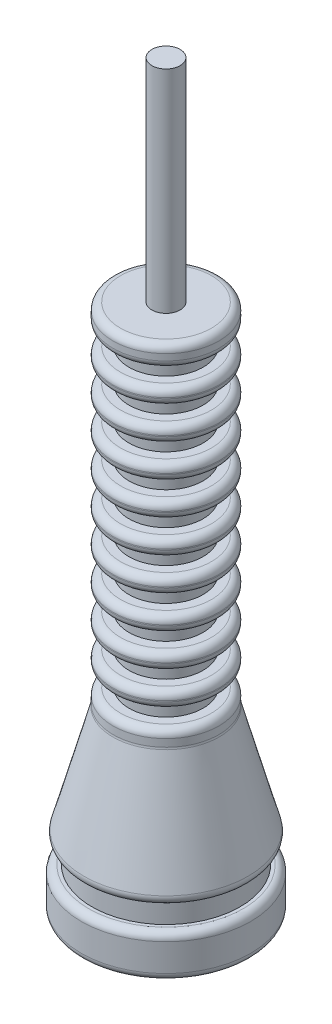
ISO-10303-21;
HEADER;
FILE_DESCRIPTION(('STEP AP214'),'2;1');
FILE_NAME('part.step','',(''),(''),'','','');
FILE_SCHEMA(('AUTOMOTIVE_DESIGN { 1 0 10303 214 1 1 1 1 }'));
ENDSEC;
DATA;
#1=APPLICATION_CONTEXT('core data for automotive mechanical design processes');
#2=APPLICATION_PROTOCOL_DEFINITION('international standard','automotive_design',2000,#1);
#3=PRODUCT_CONTEXT('',#1,'mechanical');
#4=PRODUCT('Part','Part','',(#3));
#5=PRODUCT_RELATED_PRODUCT_CATEGORY('part','',(#4));
#6=PRODUCT_DEFINITION_FORMATION('','',#4);
#7=PRODUCT_DEFINITION_CONTEXT('part definition',#1,'design');
#8=PRODUCT_DEFINITION('design','',#6,#7);
#9=PRODUCT_DEFINITION_SHAPE('','',#8);
#10=(LENGTH_UNIT() NAMED_UNIT(*) SI_UNIT(.MILLI.,.METRE.));
#11=(NAMED_UNIT(*) PLANE_ANGLE_UNIT() SI_UNIT($,.RADIAN.));
#12=(NAMED_UNIT(*) SI_UNIT($,.STERADIAN.) SOLID_ANGLE_UNIT());
#13=UNCERTAINTY_MEASURE_WITH_UNIT(LENGTH_MEASURE(1.E-05),#10,'distance_accuracy_value','');
#14=(GEOMETRIC_REPRESENTATION_CONTEXT(3) GLOBAL_UNCERTAINTY_ASSIGNED_CONTEXT((#13)) GLOBAL_UNIT_ASSIGNED_CONTEXT((#10,
#11,#12)) REPRESENTATION_CONTEXT('',''));
#15=CARTESIAN_POINT('',(0.,0.,0.));
#16=DIRECTION('',(0.,0.,1.));
#17=DIRECTION('',(1.,0.,0.));
#18=AXIS2_PLACEMENT_3D('',#15,#16,#17);
#19=CARTESIAN_POINT('',(0.,0.,0.));
#20=DIRECTION('',(0.,-1.,0.));
#21=DIRECTION('',(0.,0.,-1.));
#22=AXIS2_PLACEMENT_3D('',#19,#20,#21);
#23=PLANE('',#22);
#24=CARTESIAN_POINT('',(0.,0.,0.));
#25=DIRECTION('',(0.,-1.,0.));
#26=DIRECTION('',(0.,0.,-1.));
#27=AXIS2_PLACEMENT_3D('',#24,#25,#26);
#28=CIRCLE('',#27,7.3);
#29=CARTESIAN_POINT('',(0.,0.,-7.3));
#30=VERTEX_POINT('',#29);
#31=EDGE_CURVE('E190',#30,#30,#28,.T.);
#32=ORIENTED_EDGE('',*,*,#31,.T.);
#33=EDGE_LOOP('',(#32));
#34=FACE_BOUND('',#33,.T.);
#35=ADVANCED_FACE('F35',(#34),#23,.T.);
#36=CARTESIAN_POINT('',(0.,0.,0.));
#37=DIRECTION('',(0.,-1.,0.));
#38=DIRECTION('',(0.,0.,-1.));
#39=AXIS2_PLACEMENT_3D('',#36,#37,#38);
#40=CYLINDRICAL_SURFACE('',#39,8.);
#41=CARTESIAN_POINT('',(0.,0.7,0.));
#42=DIRECTION('',(0.,-1.,0.));
#43=DIRECTION('',(0.,0.,-1.));
#44=AXIS2_PLACEMENT_3D('',#41,#42,#43);
#45=CIRCLE('',#44,8.);
#46=CARTESIAN_POINT('',(0.,0.7,-8.));
#47=VERTEX_POINT('',#46);
#48=EDGE_CURVE('E184',#47,#47,#45,.F.);
#49=ORIENTED_EDGE('',*,*,#48,.T.);
#50=EDGE_LOOP('',(#49));
#51=FACE_BOUND('',#50,.T.);
#52=CARTESIAN_POINT('',(0.,3.3,0.));
#53=DIRECTION('',(0.,1.,0.));
#54=DIRECTION('',(0.,0.,1.));
#55=AXIS2_PLACEMENT_3D('',#52,#53,#54);
#56=CIRCLE('',#55,8.);
#57=CARTESIAN_POINT('',(0.,3.3,8.));
#58=VERTEX_POINT('',#57);
#59=EDGE_CURVE('E187',#58,#58,#56,.F.);
#60=ORIENTED_EDGE('',*,*,#59,.T.);
#61=EDGE_LOOP('',(#60));
#62=FACE_BOUND('',#61,.T.);
#63=ADVANCED_FACE('F286',(#51,#62),#40,.T.);
#64=CARTESIAN_POINT('',(8.,4.,0.));
#65=DIRECTION('',(0.,1.,0.));
#66=DIRECTION('',(0.,0.,1.));
#67=AXIS2_PLACEMENT_3D('',#64,#65,#66);
#68=PLANE('',#67);
#69=CARTESIAN_POINT('',(0.,4.,0.));
#70=DIRECTION('',(0.,1.,0.));
#71=DIRECTION('',(0.,0.,1.));
#72=AXIS2_PLACEMENT_3D('',#69,#70,#71);
#73=CIRCLE('',#72,7.3);
#74=CARTESIAN_POINT('',(0.,4.,7.3));
#75=VERTEX_POINT('',#74);
#76=EDGE_CURVE('E181',#75,#75,#73,.T.);
#77=ORIENTED_EDGE('',*,*,#76,.T.);
#78=EDGE_LOOP('',(#77));
#79=FACE_BOUND('',#78,.T.);
#80=CARTESIAN_POINT('',(0.,4.,0.));
#81=DIRECTION('',(0.,-1.,0.));
#82=DIRECTION('',(0.,0.,-1.));
#83=AXIS2_PLACEMENT_3D('',#80,#81,#82);
#84=CIRCLE('',#83,7.);
#85=CARTESIAN_POINT('',(0.,4.,-7.));
#86=VERTEX_POINT('',#85);
#87=EDGE_CURVE('E193',#86,#86,#84,.T.);
#88=ORIENTED_EDGE('',*,*,#87,.T.);
#89=EDGE_LOOP('',(#88));
#90=FACE_BOUND('',#89,.T.);
#91=ADVANCED_FACE('F292',(#79,#90),#68,.T.);
#92=CARTESIAN_POINT('',(0.,0.,0.));
#93=DIRECTION('',(0.,-1.,0.));
#94=DIRECTION('',(0.,0.,-1.));
#95=AXIS2_PLACEMENT_3D('',#92,#93,#94);
#96=CYLINDRICAL_SURFACE('',#95,7.);
#97=CARTESIAN_POINT('',(0.,6.,0.));
#98=DIRECTION('',(0.,-1.,0.));
#99=DIRECTION('',(0.,0.,-1.));
#100=AXIS2_PLACEMENT_3D('',#97,#98,#99);
#101=CIRCLE('',#100,7.);
#102=CARTESIAN_POINT('',(0.,6.,-7.));
#103=VERTEX_POINT('',#102);
#104=EDGE_CURVE('E196',#103,#103,#101,.T.);
#105=ORIENTED_EDGE('',*,*,#104,.T.);
#106=EDGE_LOOP('',(#105));
#107=FACE_BOUND('',#106,.T.);
#108=ORIENTED_EDGE('',*,*,#87,.F.);
#109=EDGE_LOOP('',(#108));
#110=FACE_BOUND('',#109,.T.);
#111=ADVANCED_FACE('F567',(#107,#110),#96,.T.);
#112=CARTESIAN_POINT('',(7.,6.,0.));
#113=DIRECTION('',(0.,-1.,0.));
#114=DIRECTION('',(0.,0.,-1.));
#115=AXIS2_PLACEMENT_3D('',#112,#113,#114);
#116=PLANE('',#115);
#117=CARTESIAN_POINT('',(0.,6.,0.));
#118=DIRECTION('',(0.,-1.,0.));
#119=DIRECTION('',(0.,0.,-1.));
#120=AXIS2_PLACEMENT_3D('',#117,#118,#119);
#121=CIRCLE('',#120,7.08352471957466);
#122=CARTESIAN_POINT('',(0.,6.,-7.08352471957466));
#123=VERTEX_POINT('',#122);
#124=EDGE_CURVE('E178',#123,#123,#121,.T.);
#125=ORIENTED_EDGE('',*,*,#124,.T.);
#126=EDGE_LOOP('',(#125));
#127=FACE_BOUND('',#126,.T.);
#128=ORIENTED_EDGE('',*,*,#104,.F.);
#129=EDGE_LOOP('',(#128));
#130=FACE_BOUND('',#129,.T.);
#131=ADVANCED_FACE('F563',(#127,#130),#116,.T.);
#132=CARTESIAN_POINT('',(0.,6.,0.));
#133=DIRECTION('',(0.,-1.,0.));
#134=DIRECTION('',(0.,0.,-1.));
#135=AXIS2_PLACEMENT_3D('',#132,#133,#134);
#136=CONICAL_SURFACE('',#135,8.,0.266252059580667);
#137=CARTESIAN_POINT('',(0.,6.88418219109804,0.));
#138=DIRECTION('',(0.,1.,0.));
#139=DIRECTION('',(0.,0.,1.));
#140=AXIS2_PLACEMENT_3D('',#137,#138,#139);
#141=CIRCLE('',#140,7.7588593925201);
#142=CARTESIAN_POINT('',(0.,6.88418219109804,7.7588593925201));
#143=VERTEX_POINT('',#142);
#144=EDGE_CURVE('E172',#143,#143,#141,.T.);
#145=ORIENTED_EDGE('',*,*,#144,.T.);
#146=EDGE_LOOP('',(#145));
#147=FACE_BOUND('',#146,.T.);
#148=CARTESIAN_POINT('',(0.,16.9095600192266,0.));
#149=DIRECTION('',(0.,-1.,0.));
#150=DIRECTION('',(0.,0.,-1.));
#151=AXIS2_PLACEMENT_3D('',#148,#149,#150);
#152=CIRCLE('',#151,5.02466532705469);
#153=CARTESIAN_POINT('',(0.,16.9095600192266,-5.02466532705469));
#154=VERTEX_POINT('',#153);
#155=EDGE_CURVE('E175',#154,#154,#152,.T.);
#156=ORIENTED_EDGE('',*,*,#155,.T.);
#157=EDGE_LOOP('',(#156));
#158=FACE_BOUND('',#157,.T.);
#159=ADVANCED_FACE('F559',(#147,#158),#136,.T.);
#160=CARTESIAN_POINT('',(0.,0.,0.));
#161=DIRECTION('',(0.,-1.,0.));
#162=DIRECTION('',(0.,0.,-1.));
#163=AXIS2_PLACEMENT_3D('',#160,#161,#162);
#164=CYLINDRICAL_SURFACE('',#163,5.00000000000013);
#165=CARTESIAN_POINT('',(0.,17.0937422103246,0.));
#166=DIRECTION('',(0.,-1.,0.));
#167=DIRECTION('',(0.,0.,-1.));
#168=AXIS2_PLACEMENT_3D('',#165,#166,#167);
#169=CIRCLE('',#168,5.00000000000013);
#170=CARTESIAN_POINT('',(0.,17.0937422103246,-5.00000000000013));
#171=VERTEX_POINT('',#170);
#172=EDGE_CURVE('E166',#171,#171,#169,.F.);
#173=ORIENTED_EDGE('',*,*,#172,.T.);
#174=EDGE_LOOP('',(#173));
#175=FACE_BOUND('',#174,.T.);
#176=CARTESIAN_POINT('',(0.,17.7999995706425,0.));
#177=DIRECTION('',(0.,1.,0.));
#178=DIRECTION('',(0.,0.,1.));
#179=AXIS2_PLACEMENT_3D('',#176,#177,#178);
#180=CIRCLE('',#179,5.00000000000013);
#181=CARTESIAN_POINT('',(0.,17.7999995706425,5.00000000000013));
#182=VERTEX_POINT('',#181);
#183=EDGE_CURVE('E169',#182,#182,#180,.F.);
#184=ORIENTED_EDGE('',*,*,#183,.T.);
#185=EDGE_LOOP('',(#184));
#186=FACE_BOUND('',#185,.T.);
#187=ADVANCED_FACE('F555',(#175,#186),#164,.T.);
#188=CARTESIAN_POINT('',(3.50000000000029,18.4999995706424,0.));
#189=DIRECTION('',(0.,1.,0.));
#190=DIRECTION('',(0.,0.,1.));
#191=AXIS2_PLACEMENT_3D('',#188,#189,#190);
#192=PLANE('',#191);
#193=CARTESIAN_POINT('',(0.,18.4999995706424,0.));
#194=DIRECTION('',(0.,1.,0.));
#195=DIRECTION('',(0.,0.,1.));
#196=AXIS2_PLACEMENT_3D('',#193,#194,#195);
#197=CIRCLE('',#196,4.30000000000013);
#198=CARTESIAN_POINT('',(0.,18.4999995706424,4.30000000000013));
#199=VERTEX_POINT('',#198);
#200=EDGE_CURVE('E163',#199,#199,#197,.T.);
#201=ORIENTED_EDGE('',*,*,#200,.T.);
#202=EDGE_LOOP('',(#201));
#203=FACE_BOUND('',#202,.T.);
#204=CARTESIAN_POINT('',(0.,18.4999995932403,0.));
#205=DIRECTION('',(0.,-1.,0.));
#206=DIRECTION('',(0.,0.,-1.));
#207=AXIS2_PLACEMENT_3D('',#204,#205,#206);
#208=CIRCLE('',#207,3.50000000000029);
#209=CARTESIAN_POINT('',(0.,18.4999995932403,-3.50000000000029));
#210=VERTEX_POINT('',#209);
#211=EDGE_CURVE('E199',#210,#210,#208,.T.);
#212=ORIENTED_EDGE('',*,*,#211,.T.);
#213=EDGE_LOOP('',(#212));
#214=FACE_BOUND('',#213,.T.);
#215=ADVANCED_FACE('F551',(#203,#214),#192,.T.);
#216=CARTESIAN_POINT('',(0.,0.,0.));
#217=DIRECTION('',(0.,-1.,0.));
#218=DIRECTION('',(0.,0.,-1.));
#219=AXIS2_PLACEMENT_3D('',#216,#217,#218);
#220=CYLINDRICAL_SURFACE('',#219,3.50000000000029);
#221=CARTESIAN_POINT('',(0.,20.0999995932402,0.));
#222=DIRECTION('',(0.,-1.,0.));
#223=DIRECTION('',(0.,0.,-1.));
#224=AXIS2_PLACEMENT_3D('',#221,#222,#223);
#225=CIRCLE('',#224,3.50000000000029);
#226=CARTESIAN_POINT('',(0.,20.0999995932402,-3.50000000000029));
#227=VERTEX_POINT('',#226);
#228=EDGE_CURVE('E202',#227,#227,#225,.T.);
#229=ORIENTED_EDGE('',*,*,#228,.T.);
#230=EDGE_LOOP('',(#229));
#231=FACE_BOUND('',#230,.T.);
#232=ORIENTED_EDGE('',*,*,#211,.F.);
#233=EDGE_LOOP('',(#232));
#234=FACE_BOUND('',#233,.T.);
#235=ADVANCED_FACE('F547',(#231,#234),#220,.T.);
#236=CARTESIAN_POINT('',(5.00000000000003,20.0999995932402,0.));
#237=DIRECTION('',(0.,-1.,0.));
#238=DIRECTION('',(0.,0.,-1.));
#239=AXIS2_PLACEMENT_3D('',#236,#237,#238);
#240=PLANE('',#239);
#241=CARTESIAN_POINT('',(0.,20.0999995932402,0.));
#242=DIRECTION('',(0.,-1.,0.));
#243=DIRECTION('',(0.,0.,-1.));
#244=AXIS2_PLACEMENT_3D('',#241,#242,#243);
#245=CIRCLE('',#244,4.30000000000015);
#246=CARTESIAN_POINT('',(0.,20.0999995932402,-4.30000000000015));
#247=VERTEX_POINT('',#246);
#248=EDGE_CURVE('E160',#247,#247,#245,.T.);
#249=ORIENTED_EDGE('',*,*,#248,.T.);
#250=EDGE_LOOP('',(#249));
#251=FACE_BOUND('',#250,.T.);
#252=ORIENTED_EDGE('',*,*,#228,.F.);
#253=EDGE_LOOP('',(#252));
#254=FACE_BOUND('',#253,.T.);
#255=ADVANCED_FACE('F543',(#251,#254),#240,.T.);
#256=CARTESIAN_POINT('',(0.,0.,0.));
#257=DIRECTION('',(0.,-1.,0.));
#258=DIRECTION('',(0.,0.,-1.));
#259=AXIS2_PLACEMENT_3D('',#256,#257,#258);
#260=CYLINDRICAL_SURFACE('',#259,5.00000000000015);
#261=CARTESIAN_POINT('',(0.,20.7999995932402,0.));
#262=DIRECTION('',(0.,-1.,0.));
#263=DIRECTION('',(0.,0.,-1.));
#264=AXIS2_PLACEMENT_3D('',#261,#262,#263);
#265=CIRCLE('',#264,5.00000000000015);
#266=CARTESIAN_POINT('',(0.,20.7999995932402,-5.00000000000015));
#267=VERTEX_POINT('',#266);
#268=EDGE_CURVE('E154',#267,#267,#265,.F.);
#269=ORIENTED_EDGE('',*,*,#268,.T.);
#270=EDGE_LOOP('',(#269));
#271=FACE_BOUND('',#270,.T.);
#272=CARTESIAN_POINT('',(0.,20.899999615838,0.));
#273=DIRECTION('',(0.,1.,0.));
#274=DIRECTION('',(0.,0.,1.));
#275=AXIS2_PLACEMENT_3D('',#272,#273,#274);
#276=CIRCLE('',#275,5.00000000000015);
#277=CARTESIAN_POINT('',(0.,20.899999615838,5.00000000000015));
#278=VERTEX_POINT('',#277);
#279=EDGE_CURVE('E157',#278,#278,#276,.F.);
#280=ORIENTED_EDGE('',*,*,#279,.T.);
#281=EDGE_LOOP('',(#280));
#282=FACE_BOUND('',#281,.T.);
#283=ADVANCED_FACE('F539',(#271,#282),#260,.T.);
#284=CARTESIAN_POINT('',(3.50000000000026,21.599999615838,0.));
#285=DIRECTION('',(0.,1.,0.));
#286=DIRECTION('',(0.,0.,1.));
#287=AXIS2_PLACEMENT_3D('',#284,#285,#286);
#288=PLANE('',#287);
#289=CARTESIAN_POINT('',(0.,21.599999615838,0.));
#290=DIRECTION('',(0.,1.,0.));
#291=DIRECTION('',(0.,0.,1.));
#292=AXIS2_PLACEMENT_3D('',#289,#290,#291);
#293=CIRCLE('',#292,4.30000000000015);
#294=CARTESIAN_POINT('',(0.,21.599999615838,4.30000000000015));
#295=VERTEX_POINT('',#294);
#296=EDGE_CURVE('E151',#295,#295,#293,.T.);
#297=ORIENTED_EDGE('',*,*,#296,.T.);
#298=EDGE_LOOP('',(#297));
#299=FACE_BOUND('',#298,.T.);
#300=CARTESIAN_POINT('',(0.,21.5999996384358,0.));
#301=DIRECTION('',(0.,-1.,0.));
#302=DIRECTION('',(0.,0.,-1.));
#303=AXIS2_PLACEMENT_3D('',#300,#301,#302);
#304=CIRCLE('',#303,3.50000000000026);
#305=CARTESIAN_POINT('',(0.,21.5999996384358,-3.50000000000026));
#306=VERTEX_POINT('',#305);
#307=EDGE_CURVE('E205',#306,#306,#304,.T.);
#308=ORIENTED_EDGE('',*,*,#307,.T.);
#309=EDGE_LOOP('',(#308));
#310=FACE_BOUND('',#309,.T.);
#311=ADVANCED_FACE('F535',(#299,#310),#288,.T.);
#312=CARTESIAN_POINT('',(0.,0.,0.));
#313=DIRECTION('',(0.,-1.,0.));
#314=DIRECTION('',(0.,0.,-1.));
#315=AXIS2_PLACEMENT_3D('',#312,#313,#314);
#316=CYLINDRICAL_SURFACE('',#315,3.50000000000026);
#317=CARTESIAN_POINT('',(0.,23.1999996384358,0.));
#318=DIRECTION('',(0.,-1.,0.));
#319=DIRECTION('',(0.,0.,-1.));
#320=AXIS2_PLACEMENT_3D('',#317,#318,#319);
#321=CIRCLE('',#320,3.50000000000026);
#322=CARTESIAN_POINT('',(0.,23.1999996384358,-3.50000000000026));
#323=VERTEX_POINT('',#322);
#324=EDGE_CURVE('E208',#323,#323,#321,.T.);
#325=ORIENTED_EDGE('',*,*,#324,.T.);
#326=EDGE_LOOP('',(#325));
#327=FACE_BOUND('',#326,.T.);
#328=ORIENTED_EDGE('',*,*,#307,.F.);
#329=EDGE_LOOP('',(#328));
#330=FACE_BOUND('',#329,.T.);
#331=ADVANCED_FACE('F531',(#327,#330),#316,.T.);
#332=CARTESIAN_POINT('',(5.00000000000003,23.1999996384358,0.));
#333=DIRECTION('',(0.,-1.,0.));
#334=DIRECTION('',(0.,0.,-1.));
#335=AXIS2_PLACEMENT_3D('',#332,#333,#334);
#336=PLANE('',#335);
#337=CARTESIAN_POINT('',(0.,23.1999996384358,0.));
#338=DIRECTION('',(0.,-1.,0.));
#339=DIRECTION('',(0.,0.,-1.));
#340=AXIS2_PLACEMENT_3D('',#337,#338,#339);
#341=CIRCLE('',#340,4.30000000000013);
#342=CARTESIAN_POINT('',(0.,23.1999996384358,-4.30000000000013));
#343=VERTEX_POINT('',#342);
#344=EDGE_CURVE('E148',#343,#343,#341,.T.);
#345=ORIENTED_EDGE('',*,*,#344,.T.);
#346=EDGE_LOOP('',(#345));
#347=FACE_BOUND('',#346,.T.);
#348=ORIENTED_EDGE('',*,*,#324,.F.);
#349=EDGE_LOOP('',(#348));
#350=FACE_BOUND('',#349,.T.);
#351=ADVANCED_FACE('F527',(#347,#350),#336,.T.);
#352=CARTESIAN_POINT('',(0.,0.,0.));
#353=DIRECTION('',(0.,-1.,0.));
#354=DIRECTION('',(0.,0.,-1.));
#355=AXIS2_PLACEMENT_3D('',#352,#353,#354);
#356=CYLINDRICAL_SURFACE('',#355,5.00000000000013);
#357=CARTESIAN_POINT('',(0.,23.8999996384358,0.));
#358=DIRECTION('',(0.,-1.,0.));
#359=DIRECTION('',(0.,0.,-1.));
#360=AXIS2_PLACEMENT_3D('',#357,#358,#359);
#361=CIRCLE('',#360,5.00000000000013);
#362=CARTESIAN_POINT('',(0.,23.8999996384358,-5.00000000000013));
#363=VERTEX_POINT('',#362);
#364=EDGE_CURVE('E142',#363,#363,#361,.F.);
#365=ORIENTED_EDGE('',*,*,#364,.T.);
#366=EDGE_LOOP('',(#365));
#367=FACE_BOUND('',#366,.T.);
#368=CARTESIAN_POINT('',(0.,23.9999996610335,0.));
#369=DIRECTION('',(0.,1.,0.));
#370=DIRECTION('',(0.,0.,1.));
#371=AXIS2_PLACEMENT_3D('',#368,#369,#370);
#372=CIRCLE('',#371,5.00000000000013);
#373=CARTESIAN_POINT('',(0.,23.9999996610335,5.00000000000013));
#374=VERTEX_POINT('',#373);
#375=EDGE_CURVE('E145',#374,#374,#372,.F.);
#376=ORIENTED_EDGE('',*,*,#375,.T.);
#377=EDGE_LOOP('',(#376));
#378=FACE_BOUND('',#377,.T.);
#379=ADVANCED_FACE('F523',(#367,#378),#356,.T.);
#380=CARTESIAN_POINT('',(3.50000000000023,24.6999996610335,0.));
#381=DIRECTION('',(0.,1.,0.));
#382=DIRECTION('',(0.,0.,1.));
#383=AXIS2_PLACEMENT_3D('',#380,#381,#382);
#384=PLANE('',#383);
#385=CARTESIAN_POINT('',(0.,24.6999996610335,0.));
#386=DIRECTION('',(0.,1.,0.));
#387=DIRECTION('',(0.,0.,1.));
#388=AXIS2_PLACEMENT_3D('',#385,#386,#387);
#389=CIRCLE('',#388,4.30000000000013);
#390=CARTESIAN_POINT('',(0.,24.6999996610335,4.30000000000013));
#391=VERTEX_POINT('',#390);
#392=EDGE_CURVE('E139',#391,#391,#389,.T.);
#393=ORIENTED_EDGE('',*,*,#392,.T.);
#394=EDGE_LOOP('',(#393));
#395=FACE_BOUND('',#394,.T.);
#396=CARTESIAN_POINT('',(0.,24.6999996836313,0.));
#397=DIRECTION('',(0.,-1.,0.));
#398=DIRECTION('',(0.,0.,-1.));
#399=AXIS2_PLACEMENT_3D('',#396,#397,#398);
#400=CIRCLE('',#399,3.50000000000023);
#401=CARTESIAN_POINT('',(0.,24.6999996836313,-3.50000000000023));
#402=VERTEX_POINT('',#401);
#403=EDGE_CURVE('E211',#402,#402,#400,.T.);
#404=ORIENTED_EDGE('',*,*,#403,.T.);
#405=EDGE_LOOP('',(#404));
#406=FACE_BOUND('',#405,.T.);
#407=ADVANCED_FACE('F519',(#395,#406),#384,.T.);
#408=CARTESIAN_POINT('',(0.,0.,0.));
#409=DIRECTION('',(0.,-1.,0.));
#410=DIRECTION('',(0.,0.,-1.));
#411=AXIS2_PLACEMENT_3D('',#408,#409,#410);
#412=CYLINDRICAL_SURFACE('',#411,3.50000000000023);
#413=CARTESIAN_POINT('',(0.,26.2999996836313,0.));
#414=DIRECTION('',(0.,-1.,0.));
#415=DIRECTION('',(0.,0.,-1.));
#416=AXIS2_PLACEMENT_3D('',#413,#414,#415);
#417=CIRCLE('',#416,3.50000000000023);
#418=CARTESIAN_POINT('',(0.,26.2999996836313,-3.50000000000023));
#419=VERTEX_POINT('',#418);
#420=EDGE_CURVE('E214',#419,#419,#417,.T.);
#421=ORIENTED_EDGE('',*,*,#420,.T.);
#422=EDGE_LOOP('',(#421));
#423=FACE_BOUND('',#422,.T.);
#424=ORIENTED_EDGE('',*,*,#403,.F.);
#425=EDGE_LOOP('',(#424));
#426=FACE_BOUND('',#425,.T.);
#427=ADVANCED_FACE('F515',(#423,#426),#412,.T.);
#428=CARTESIAN_POINT('',(5.00000000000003,26.2999996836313,0.));
#429=DIRECTION('',(0.,-1.,0.));
#430=DIRECTION('',(0.,0.,-1.));
#431=AXIS2_PLACEMENT_3D('',#428,#429,#430);
#432=PLANE('',#431);
#433=CARTESIAN_POINT('',(0.,26.2999996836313,0.));
#434=DIRECTION('',(0.,-1.,0.));
#435=DIRECTION('',(0.,0.,-1.));
#436=AXIS2_PLACEMENT_3D('',#433,#434,#435);
#437=CIRCLE('',#436,4.30000000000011);
#438=CARTESIAN_POINT('',(0.,26.2999996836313,-4.30000000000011));
#439=VERTEX_POINT('',#438);
#440=EDGE_CURVE('E136',#439,#439,#437,.T.);
#441=ORIENTED_EDGE('',*,*,#440,.T.);
#442=EDGE_LOOP('',(#441));
#443=FACE_BOUND('',#442,.T.);
#444=ORIENTED_EDGE('',*,*,#420,.F.);
#445=EDGE_LOOP('',(#444));
#446=FACE_BOUND('',#445,.T.);
#447=ADVANCED_FACE('F511',(#443,#446),#432,.T.);
#448=CARTESIAN_POINT('',(0.,0.,0.));
#449=DIRECTION('',(0.,-1.,0.));
#450=DIRECTION('',(0.,0.,-1.));
#451=AXIS2_PLACEMENT_3D('',#448,#449,#450);
#452=CYLINDRICAL_SURFACE('',#451,5.00000000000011);
#453=CARTESIAN_POINT('',(0.,26.9999996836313,0.));
#454=DIRECTION('',(0.,-1.,0.));
#455=DIRECTION('',(0.,0.,-1.));
#456=AXIS2_PLACEMENT_3D('',#453,#454,#455);
#457=CIRCLE('',#456,5.00000000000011);
#458=CARTESIAN_POINT('',(0.,26.9999996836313,-5.00000000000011));
#459=VERTEX_POINT('',#458);
#460=EDGE_CURVE('E130',#459,#459,#457,.F.);
#461=ORIENTED_EDGE('',*,*,#460,.T.);
#462=EDGE_LOOP('',(#461));
#463=FACE_BOUND('',#462,.T.);
#464=CARTESIAN_POINT('',(0.,27.0999997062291,0.));
#465=DIRECTION('',(0.,1.,0.));
#466=DIRECTION('',(0.,0.,1.));
#467=AXIS2_PLACEMENT_3D('',#464,#465,#466);
#468=CIRCLE('',#467,5.00000000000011);
#469=CARTESIAN_POINT('',(0.,27.0999997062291,5.00000000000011));
#470=VERTEX_POINT('',#469);
#471=EDGE_CURVE('E133',#470,#470,#468,.F.);
#472=ORIENTED_EDGE('',*,*,#471,.T.);
#473=EDGE_LOOP('',(#472));
#474=FACE_BOUND('',#473,.T.);
#475=ADVANCED_FACE('F507',(#463,#474),#452,.T.);
#476=CARTESIAN_POINT('',(3.50000000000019,27.7999997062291,0.));
#477=DIRECTION('',(0.,1.,0.));
#478=DIRECTION('',(0.,0.,1.));
#479=AXIS2_PLACEMENT_3D('',#476,#477,#478);
#480=PLANE('',#479);
#481=CARTESIAN_POINT('',(0.,27.7999997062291,0.));
#482=DIRECTION('',(0.,1.,0.));
#483=DIRECTION('',(0.,0.,1.));
#484=AXIS2_PLACEMENT_3D('',#481,#482,#483);
#485=CIRCLE('',#484,4.30000000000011);
#486=CARTESIAN_POINT('',(0.,27.7999997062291,4.30000000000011));
#487=VERTEX_POINT('',#486);
#488=EDGE_CURVE('E127',#487,#487,#485,.T.);
#489=ORIENTED_EDGE('',*,*,#488,.T.);
#490=EDGE_LOOP('',(#489));
#491=FACE_BOUND('',#490,.T.);
#492=CARTESIAN_POINT('',(0.,27.7999997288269,0.));
#493=DIRECTION('',(0.,-1.,0.));
#494=DIRECTION('',(0.,0.,-1.));
#495=AXIS2_PLACEMENT_3D('',#492,#493,#494);
#496=CIRCLE('',#495,3.50000000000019);
#497=CARTESIAN_POINT('',(0.,27.7999997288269,-3.50000000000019));
#498=VERTEX_POINT('',#497);
#499=EDGE_CURVE('E217',#498,#498,#496,.T.);
#500=ORIENTED_EDGE('',*,*,#499,.T.);
#501=EDGE_LOOP('',(#500));
#502=FACE_BOUND('',#501,.T.);
#503=ADVANCED_FACE('F503',(#491,#502),#480,.T.);
#504=CARTESIAN_POINT('',(0.,0.,0.));
#505=DIRECTION('',(0.,-1.,0.));
#506=DIRECTION('',(0.,0.,-1.));
#507=AXIS2_PLACEMENT_3D('',#504,#505,#506);
#508=CYLINDRICAL_SURFACE('',#507,3.50000000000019);
#509=CARTESIAN_POINT('',(0.,29.3999997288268,0.));
#510=DIRECTION('',(0.,-1.,0.));
#511=DIRECTION('',(0.,0.,-1.));
#512=AXIS2_PLACEMENT_3D('',#509,#510,#511);
#513=CIRCLE('',#512,3.50000000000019);
#514=CARTESIAN_POINT('',(0.,29.3999997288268,-3.50000000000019));
#515=VERTEX_POINT('',#514);
#516=EDGE_CURVE('E220',#515,#515,#513,.T.);
#517=ORIENTED_EDGE('',*,*,#516,.T.);
#518=EDGE_LOOP('',(#517));
#519=FACE_BOUND('',#518,.T.);
#520=ORIENTED_EDGE('',*,*,#499,.F.);
#521=EDGE_LOOP('',(#520));
#522=FACE_BOUND('',#521,.T.);
#523=ADVANCED_FACE('F499',(#519,#522),#508,.T.);
#524=CARTESIAN_POINT('',(5.00000000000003,29.3999997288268,0.));
#525=DIRECTION('',(0.,-1.,0.));
#526=DIRECTION('',(0.,0.,-1.));
#527=AXIS2_PLACEMENT_3D('',#524,#525,#526);
#528=PLANE('',#527);
#529=CARTESIAN_POINT('',(0.,29.3999997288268,0.));
#530=DIRECTION('',(0.,-1.,0.));
#531=DIRECTION('',(0.,0.,-1.));
#532=AXIS2_PLACEMENT_3D('',#529,#530,#531);
#533=CIRCLE('',#532,4.3000000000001);
#534=CARTESIAN_POINT('',(0.,29.3999997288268,-4.3000000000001));
#535=VERTEX_POINT('',#534);
#536=EDGE_CURVE('E124',#535,#535,#533,.T.);
#537=ORIENTED_EDGE('',*,*,#536,.T.);
#538=EDGE_LOOP('',(#537));
#539=FACE_BOUND('',#538,.T.);
#540=ORIENTED_EDGE('',*,*,#516,.F.);
#541=EDGE_LOOP('',(#540));
#542=FACE_BOUND('',#541,.T.);
#543=ADVANCED_FACE('F495',(#539,#542),#528,.T.);
#544=CARTESIAN_POINT('',(0.,0.,0.));
#545=DIRECTION('',(0.,-1.,0.));
#546=DIRECTION('',(0.,0.,-1.));
#547=AXIS2_PLACEMENT_3D('',#544,#545,#546);
#548=CYLINDRICAL_SURFACE('',#547,5.0000000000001);
#549=CARTESIAN_POINT('',(0.,30.0999997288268,0.));
#550=DIRECTION('',(0.,-1.,0.));
#551=DIRECTION('',(0.,0.,-1.));
#552=AXIS2_PLACEMENT_3D('',#549,#550,#551);
#553=CIRCLE('',#552,5.0000000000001);
#554=CARTESIAN_POINT('',(0.,30.0999997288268,-5.0000000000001));
#555=VERTEX_POINT('',#554);
#556=EDGE_CURVE('E118',#555,#555,#553,.F.);
#557=ORIENTED_EDGE('',*,*,#556,.T.);
#558=EDGE_LOOP('',(#557));
#559=FACE_BOUND('',#558,.T.);
#560=CARTESIAN_POINT('',(0.,30.1999997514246,0.));
#561=DIRECTION('',(0.,1.,0.));
#562=DIRECTION('',(0.,0.,1.));
#563=AXIS2_PLACEMENT_3D('',#560,#561,#562);
#564=CIRCLE('',#563,5.0000000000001);
#565=CARTESIAN_POINT('',(0.,30.1999997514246,5.0000000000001));
#566=VERTEX_POINT('',#565);
#567=EDGE_CURVE('E121',#566,#566,#564,.F.);
#568=ORIENTED_EDGE('',*,*,#567,.T.);
#569=EDGE_LOOP('',(#568));
#570=FACE_BOUND('',#569,.T.);
#571=ADVANCED_FACE('F491',(#559,#570),#548,.T.);
#572=CARTESIAN_POINT('',(3.50000000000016,30.8999997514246,0.));
#573=DIRECTION('',(0.,1.,0.));
#574=DIRECTION('',(0.,0.,1.));
#575=AXIS2_PLACEMENT_3D('',#572,#573,#574);
#576=PLANE('',#575);
#577=CARTESIAN_POINT('',(0.,30.8999997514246,0.));
#578=DIRECTION('',(0.,1.,0.));
#579=DIRECTION('',(0.,0.,1.));
#580=AXIS2_PLACEMENT_3D('',#577,#578,#579);
#581=CIRCLE('',#580,4.3000000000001);
#582=CARTESIAN_POINT('',(0.,30.8999997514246,4.3000000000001));
#583=VERTEX_POINT('',#582);
#584=EDGE_CURVE('E115',#583,#583,#581,.T.);
#585=ORIENTED_EDGE('',*,*,#584,.T.);
#586=EDGE_LOOP('',(#585));
#587=FACE_BOUND('',#586,.T.);
#588=CARTESIAN_POINT('',(0.,30.8999997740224,0.));
#589=DIRECTION('',(0.,-1.,0.));
#590=DIRECTION('',(0.,0.,-1.));
#591=AXIS2_PLACEMENT_3D('',#588,#589,#590);
#592=CIRCLE('',#591,3.50000000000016);
#593=CARTESIAN_POINT('',(0.,30.8999997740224,-3.50000000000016));
#594=VERTEX_POINT('',#593);
#595=EDGE_CURVE('E223',#594,#594,#592,.T.);
#596=ORIENTED_EDGE('',*,*,#595,.T.);
#597=EDGE_LOOP('',(#596));
#598=FACE_BOUND('',#597,.T.);
#599=ADVANCED_FACE('F487',(#587,#598),#576,.T.);
#600=CARTESIAN_POINT('',(0.,0.,0.));
#601=DIRECTION('',(0.,-1.,0.));
#602=DIRECTION('',(0.,0.,-1.));
#603=AXIS2_PLACEMENT_3D('',#600,#601,#602);
#604=CYLINDRICAL_SURFACE('',#603,3.50000000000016);
#605=CARTESIAN_POINT('',(0.,32.4999997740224,0.));
#606=DIRECTION('',(0.,-1.,0.));
#607=DIRECTION('',(0.,0.,-1.));
#608=AXIS2_PLACEMENT_3D('',#605,#606,#607);
#609=CIRCLE('',#608,3.50000000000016);
#610=CARTESIAN_POINT('',(0.,32.4999997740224,-3.50000000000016));
#611=VERTEX_POINT('',#610);
#612=EDGE_CURVE('E226',#611,#611,#609,.T.);
#613=ORIENTED_EDGE('',*,*,#612,.T.);
#614=EDGE_LOOP('',(#613));
#615=FACE_BOUND('',#614,.T.);
#616=ORIENTED_EDGE('',*,*,#595,.F.);
#617=EDGE_LOOP('',(#616));
#618=FACE_BOUND('',#617,.T.);
#619=ADVANCED_FACE('F483',(#615,#618),#604,.T.);
#620=CARTESIAN_POINT('',(5.00000000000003,32.4999997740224,0.));
#621=DIRECTION('',(0.,-1.,0.));
#622=DIRECTION('',(0.,0.,-1.));
#623=AXIS2_PLACEMENT_3D('',#620,#621,#622);
#624=PLANE('',#623);
#625=CARTESIAN_POINT('',(0.,32.4999997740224,0.));
#626=DIRECTION('',(0.,-1.,0.));
#627=DIRECTION('',(0.,0.,-1.));
#628=AXIS2_PLACEMENT_3D('',#625,#626,#627);
#629=CIRCLE('',#628,4.30000000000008);
#630=CARTESIAN_POINT('',(0.,32.4999997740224,-4.30000000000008));
#631=VERTEX_POINT('',#630);
#632=EDGE_CURVE('E112',#631,#631,#629,.T.);
#633=ORIENTED_EDGE('',*,*,#632,.T.);
#634=EDGE_LOOP('',(#633));
#635=FACE_BOUND('',#634,.T.);
#636=ORIENTED_EDGE('',*,*,#612,.F.);
#637=EDGE_LOOP('',(#636));
#638=FACE_BOUND('',#637,.T.);
#639=ADVANCED_FACE('F479',(#635,#638),#624,.T.);
#640=CARTESIAN_POINT('',(0.,0.,0.));
#641=DIRECTION('',(0.,-1.,0.));
#642=DIRECTION('',(0.,0.,-1.));
#643=AXIS2_PLACEMENT_3D('',#640,#641,#642);
#644=CYLINDRICAL_SURFACE('',#643,5.00000000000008);
#645=CARTESIAN_POINT('',(0.,33.1999997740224,0.));
#646=DIRECTION('',(0.,-1.,0.));
#647=DIRECTION('',(0.,0.,-1.));
#648=AXIS2_PLACEMENT_3D('',#645,#646,#647);
#649=CIRCLE('',#648,5.00000000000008);
#650=CARTESIAN_POINT('',(0.,33.1999997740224,-5.00000000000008));
#651=VERTEX_POINT('',#650);
#652=EDGE_CURVE('E106',#651,#651,#649,.F.);
#653=ORIENTED_EDGE('',*,*,#652,.T.);
#654=EDGE_LOOP('',(#653));
#655=FACE_BOUND('',#654,.T.);
#656=CARTESIAN_POINT('',(0.,33.2999997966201,0.));
#657=DIRECTION('',(0.,1.,0.));
#658=DIRECTION('',(0.,0.,1.));
#659=AXIS2_PLACEMENT_3D('',#656,#657,#658);
#660=CIRCLE('',#659,5.00000000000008);
#661=CARTESIAN_POINT('',(0.,33.2999997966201,5.00000000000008));
#662=VERTEX_POINT('',#661);
#663=EDGE_CURVE('E109',#662,#662,#660,.F.);
#664=ORIENTED_EDGE('',*,*,#663,.T.);
#665=EDGE_LOOP('',(#664));
#666=FACE_BOUND('',#665,.T.);
#667=ADVANCED_FACE('F475',(#655,#666),#644,.T.);
#668=CARTESIAN_POINT('',(3.50000000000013,33.9999997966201,0.));
#669=DIRECTION('',(0.,1.,0.));
#670=DIRECTION('',(0.,0.,1.));
#671=AXIS2_PLACEMENT_3D('',#668,#669,#670);
#672=PLANE('',#671);
#673=CARTESIAN_POINT('',(0.,33.9999997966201,0.));
#674=DIRECTION('',(0.,1.,0.));
#675=DIRECTION('',(0.,0.,1.));
#676=AXIS2_PLACEMENT_3D('',#673,#674,#675);
#677=CIRCLE('',#676,4.30000000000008);
#678=CARTESIAN_POINT('',(0.,33.9999997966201,4.30000000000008));
#679=VERTEX_POINT('',#678);
#680=EDGE_CURVE('E103',#679,#679,#677,.T.);
#681=ORIENTED_EDGE('',*,*,#680,.T.);
#682=EDGE_LOOP('',(#681));
#683=FACE_BOUND('',#682,.T.);
#684=CARTESIAN_POINT('',(0.,33.9999998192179,0.));
#685=DIRECTION('',(0.,-1.,0.));
#686=DIRECTION('',(0.,0.,-1.));
#687=AXIS2_PLACEMENT_3D('',#684,#685,#686);
#688=CIRCLE('',#687,3.50000000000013);
#689=CARTESIAN_POINT('',(0.,33.9999998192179,-3.50000000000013));
#690=VERTEX_POINT('',#689);
#691=EDGE_CURVE('E229',#690,#690,#688,.T.);
#692=ORIENTED_EDGE('',*,*,#691,.T.);
#693=EDGE_LOOP('',(#692));
#694=FACE_BOUND('',#693,.T.);
#695=ADVANCED_FACE('F471',(#683,#694),#672,.T.);
#696=CARTESIAN_POINT('',(0.,0.,0.));
#697=DIRECTION('',(0.,-1.,0.));
#698=DIRECTION('',(0.,0.,-1.));
#699=AXIS2_PLACEMENT_3D('',#696,#697,#698);
#700=CYLINDRICAL_SURFACE('',#699,3.50000000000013);
#701=CARTESIAN_POINT('',(0.,35.5999998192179,0.));
#702=DIRECTION('',(0.,-1.,0.));
#703=DIRECTION('',(0.,0.,-1.));
#704=AXIS2_PLACEMENT_3D('',#701,#702,#703);
#705=CIRCLE('',#704,3.50000000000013);
#706=CARTESIAN_POINT('',(0.,35.5999998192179,-3.50000000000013));
#707=VERTEX_POINT('',#706);
#708=EDGE_CURVE('E232',#707,#707,#705,.T.);
#709=ORIENTED_EDGE('',*,*,#708,.T.);
#710=EDGE_LOOP('',(#709));
#711=FACE_BOUND('',#710,.T.);
#712=ORIENTED_EDGE('',*,*,#691,.F.);
#713=EDGE_LOOP('',(#712));
#714=FACE_BOUND('',#713,.T.);
#715=ADVANCED_FACE('F467',(#711,#714),#700,.T.);
#716=CARTESIAN_POINT('',(5.00000000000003,35.5999998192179,0.));
#717=DIRECTION('',(0.,-1.,0.));
#718=DIRECTION('',(0.,0.,-1.));
#719=AXIS2_PLACEMENT_3D('',#716,#717,#718);
#720=PLANE('',#719);
#721=CARTESIAN_POINT('',(0.,35.5999998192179,0.));
#722=DIRECTION('',(0.,-1.,0.));
#723=DIRECTION('',(0.,0.,-1.));
#724=AXIS2_PLACEMENT_3D('',#721,#722,#723);
#725=CIRCLE('',#724,4.30000000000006);
#726=CARTESIAN_POINT('',(0.,35.5999998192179,-4.30000000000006));
#727=VERTEX_POINT('',#726);
#728=EDGE_CURVE('E100',#727,#727,#725,.T.);
#729=ORIENTED_EDGE('',*,*,#728,.T.);
#730=EDGE_LOOP('',(#729));
#731=FACE_BOUND('',#730,.T.);
#732=ORIENTED_EDGE('',*,*,#708,.F.);
#733=EDGE_LOOP('',(#732));
#734=FACE_BOUND('',#733,.T.);
#735=ADVANCED_FACE('F463',(#731,#734),#720,.T.);
#736=CARTESIAN_POINT('',(0.,0.,0.));
#737=DIRECTION('',(0.,-1.,0.));
#738=DIRECTION('',(0.,0.,-1.));
#739=AXIS2_PLACEMENT_3D('',#736,#737,#738);
#740=CYLINDRICAL_SURFACE('',#739,5.00000000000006);
#741=CARTESIAN_POINT('',(0.,36.2999998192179,0.));
#742=DIRECTION('',(0.,-1.,0.));
#743=DIRECTION('',(0.,0.,-1.));
#744=AXIS2_PLACEMENT_3D('',#741,#742,#743);
#745=CIRCLE('',#744,5.00000000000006);
#746=CARTESIAN_POINT('',(0.,36.2999998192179,-5.00000000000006));
#747=VERTEX_POINT('',#746);
#748=EDGE_CURVE('E94',#747,#747,#745,.F.);
#749=ORIENTED_EDGE('',*,*,#748,.T.);
#750=EDGE_LOOP('',(#749));
#751=FACE_BOUND('',#750,.T.);
#752=CARTESIAN_POINT('',(0.,36.3999998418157,0.));
#753=DIRECTION('',(0.,1.,0.));
#754=DIRECTION('',(0.,0.,1.));
#755=AXIS2_PLACEMENT_3D('',#752,#753,#754);
#756=CIRCLE('',#755,5.00000000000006);
#757=CARTESIAN_POINT('',(0.,36.3999998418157,5.00000000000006));
#758=VERTEX_POINT('',#757);
#759=EDGE_CURVE('E97',#758,#758,#756,.F.);
#760=ORIENTED_EDGE('',*,*,#759,.T.);
#761=EDGE_LOOP('',(#760));
#762=FACE_BOUND('',#761,.T.);
#763=ADVANCED_FACE('F459',(#751,#762),#740,.T.);
#764=CARTESIAN_POINT('',(3.5000000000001,37.0999998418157,0.));
#765=DIRECTION('',(0.,1.,0.));
#766=DIRECTION('',(0.,0.,1.));
#767=AXIS2_PLACEMENT_3D('',#764,#765,#766);
#768=PLANE('',#767);
#769=CARTESIAN_POINT('',(0.,37.0999998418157,0.));
#770=DIRECTION('',(0.,1.,0.));
#771=DIRECTION('',(0.,0.,1.));
#772=AXIS2_PLACEMENT_3D('',#769,#770,#771);
#773=CIRCLE('',#772,4.30000000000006);
#774=CARTESIAN_POINT('',(0.,37.0999998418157,4.30000000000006));
#775=VERTEX_POINT('',#774);
#776=EDGE_CURVE('E91',#775,#775,#773,.T.);
#777=ORIENTED_EDGE('',*,*,#776,.T.);
#778=EDGE_LOOP('',(#777));
#779=FACE_BOUND('',#778,.T.);
#780=CARTESIAN_POINT('',(0.,37.0999998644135,0.));
#781=DIRECTION('',(0.,-1.,0.));
#782=DIRECTION('',(0.,0.,-1.));
#783=AXIS2_PLACEMENT_3D('',#780,#781,#782);
#784=CIRCLE('',#783,3.5000000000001);
#785=CARTESIAN_POINT('',(0.,37.0999998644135,-3.5000000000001));
#786=VERTEX_POINT('',#785);
#787=EDGE_CURVE('E235',#786,#786,#784,.T.);
#788=ORIENTED_EDGE('',*,*,#787,.T.);
#789=EDGE_LOOP('',(#788));
#790=FACE_BOUND('',#789,.T.);
#791=ADVANCED_FACE('F455',(#779,#790),#768,.T.);
#792=CARTESIAN_POINT('',(0.,0.,0.));
#793=DIRECTION('',(0.,-1.,0.));
#794=DIRECTION('',(0.,0.,-1.));
#795=AXIS2_PLACEMENT_3D('',#792,#793,#794);
#796=CYLINDRICAL_SURFACE('',#795,3.5000000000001);
#797=CARTESIAN_POINT('',(0.,38.6999998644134,0.));
#798=DIRECTION('',(0.,-1.,0.));
#799=DIRECTION('',(0.,0.,-1.));
#800=AXIS2_PLACEMENT_3D('',#797,#798,#799);
#801=CIRCLE('',#800,3.5000000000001);
#802=CARTESIAN_POINT('',(0.,38.6999998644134,-3.5000000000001));
#803=VERTEX_POINT('',#802);
#804=EDGE_CURVE('E238',#803,#803,#801,.T.);
#805=ORIENTED_EDGE('',*,*,#804,.T.);
#806=EDGE_LOOP('',(#805));
#807=FACE_BOUND('',#806,.T.);
#808=ORIENTED_EDGE('',*,*,#787,.F.);
#809=EDGE_LOOP('',(#808));
#810=FACE_BOUND('',#809,.T.);
#811=ADVANCED_FACE('F451',(#807,#810),#796,.T.);
#812=CARTESIAN_POINT('',(5.00000000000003,38.6999998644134,0.));
#813=DIRECTION('',(0.,-1.,0.));
#814=DIRECTION('',(0.,0.,-1.));
#815=AXIS2_PLACEMENT_3D('',#812,#813,#814);
#816=PLANE('',#815);
#817=CARTESIAN_POINT('',(0.,38.6999998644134,0.));
#818=DIRECTION('',(0.,-1.,0.));
#819=DIRECTION('',(0.,0.,-1.));
#820=AXIS2_PLACEMENT_3D('',#817,#818,#819);
#821=CIRCLE('',#820,4.30000000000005);
#822=CARTESIAN_POINT('',(0.,38.6999998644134,-4.30000000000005));
#823=VERTEX_POINT('',#822);
#824=EDGE_CURVE('E88',#823,#823,#821,.T.);
#825=ORIENTED_EDGE('',*,*,#824,.T.);
#826=EDGE_LOOP('',(#825));
#827=FACE_BOUND('',#826,.T.);
#828=ORIENTED_EDGE('',*,*,#804,.F.);
#829=EDGE_LOOP('',(#828));
#830=FACE_BOUND('',#829,.T.);
#831=ADVANCED_FACE('F447',(#827,#830),#816,.T.);
#832=CARTESIAN_POINT('',(0.,0.,0.));
#833=DIRECTION('',(0.,-1.,0.));
#834=DIRECTION('',(0.,0.,-1.));
#835=AXIS2_PLACEMENT_3D('',#832,#833,#834);
#836=CYLINDRICAL_SURFACE('',#835,5.00000000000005);
#837=CARTESIAN_POINT('',(0.,39.3999998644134,0.));
#838=DIRECTION('',(0.,-1.,0.));
#839=DIRECTION('',(0.,0.,-1.));
#840=AXIS2_PLACEMENT_3D('',#837,#838,#839);
#841=CIRCLE('',#840,5.00000000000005);
#842=CARTESIAN_POINT('',(0.,39.3999998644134,-5.00000000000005));
#843=VERTEX_POINT('',#842);
#844=EDGE_CURVE('E82',#843,#843,#841,.F.);
#845=ORIENTED_EDGE('',*,*,#844,.T.);
#846=EDGE_LOOP('',(#845));
#847=FACE_BOUND('',#846,.T.);
#848=CARTESIAN_POINT('',(0.,39.4999998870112,0.));
#849=DIRECTION('',(0.,1.,0.));
#850=DIRECTION('',(0.,0.,1.));
#851=AXIS2_PLACEMENT_3D('',#848,#849,#850);
#852=CIRCLE('',#851,5.00000000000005);
#853=CARTESIAN_POINT('',(0.,39.4999998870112,5.00000000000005));
#854=VERTEX_POINT('',#853);
#855=EDGE_CURVE('E85',#854,#854,#852,.F.);
#856=ORIENTED_EDGE('',*,*,#855,.T.);
#857=EDGE_LOOP('',(#856));
#858=FACE_BOUND('',#857,.T.);
#859=ADVANCED_FACE('F443',(#847,#858),#836,.T.);
#860=CARTESIAN_POINT('',(3.50000000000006,40.1999998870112,0.));
#861=DIRECTION('',(0.,1.,0.));
#862=DIRECTION('',(0.,0.,1.));
#863=AXIS2_PLACEMENT_3D('',#860,#861,#862);
#864=PLANE('',#863);
#865=CARTESIAN_POINT('',(0.,40.1999998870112,0.));
#866=DIRECTION('',(0.,1.,0.));
#867=DIRECTION('',(0.,0.,1.));
#868=AXIS2_PLACEMENT_3D('',#865,#866,#867);
#869=CIRCLE('',#868,4.30000000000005);
#870=CARTESIAN_POINT('',(0.,40.1999998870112,4.30000000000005));
#871=VERTEX_POINT('',#870);
#872=EDGE_CURVE('E79',#871,#871,#869,.T.);
#873=ORIENTED_EDGE('',*,*,#872,.T.);
#874=EDGE_LOOP('',(#873));
#875=FACE_BOUND('',#874,.T.);
#876=CARTESIAN_POINT('',(0.,40.199999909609,0.));
#877=DIRECTION('',(0.,-1.,0.));
#878=DIRECTION('',(0.,0.,-1.));
#879=AXIS2_PLACEMENT_3D('',#876,#877,#878);
#880=CIRCLE('',#879,3.50000000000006);
#881=CARTESIAN_POINT('',(0.,40.199999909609,-3.50000000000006));
#882=VERTEX_POINT('',#881);
#883=EDGE_CURVE('E241',#882,#882,#880,.T.);
#884=ORIENTED_EDGE('',*,*,#883,.T.);
#885=EDGE_LOOP('',(#884));
#886=FACE_BOUND('',#885,.T.);
#887=ADVANCED_FACE('F439',(#875,#886),#864,.T.);
#888=CARTESIAN_POINT('',(0.,0.,0.));
#889=DIRECTION('',(0.,-1.,0.));
#890=DIRECTION('',(0.,0.,-1.));
#891=AXIS2_PLACEMENT_3D('',#888,#889,#890);
#892=CYLINDRICAL_SURFACE('',#891,3.50000000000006);
#893=CARTESIAN_POINT('',(0.,41.799999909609,0.));
#894=DIRECTION('',(0.,-1.,0.));
#895=DIRECTION('',(0.,0.,-1.));
#896=AXIS2_PLACEMENT_3D('',#893,#894,#895);
#897=CIRCLE('',#896,3.50000000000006);
#898=CARTESIAN_POINT('',(0.,41.799999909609,-3.50000000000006));
#899=VERTEX_POINT('',#898);
#900=EDGE_CURVE('E244',#899,#899,#897,.T.);
#901=ORIENTED_EDGE('',*,*,#900,.T.);
#902=EDGE_LOOP('',(#901));
#903=FACE_BOUND('',#902,.T.);
#904=ORIENTED_EDGE('',*,*,#883,.F.);
#905=EDGE_LOOP('',(#904));
#906=FACE_BOUND('',#905,.T.);
#907=ADVANCED_FACE('F435',(#903,#906),#892,.T.);
#908=CARTESIAN_POINT('',(5.00000000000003,41.799999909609,0.));
#909=DIRECTION('',(0.,-1.,0.));
#910=DIRECTION('',(0.,0.,-1.));
#911=AXIS2_PLACEMENT_3D('',#908,#909,#910);
#912=PLANE('',#911);
#913=CARTESIAN_POINT('',(0.,41.799999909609,0.));
#914=DIRECTION('',(0.,-1.,0.));
#915=DIRECTION('',(0.,0.,-1.));
#916=AXIS2_PLACEMENT_3D('',#913,#914,#915);
#917=CIRCLE('',#916,4.30000000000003);
#918=CARTESIAN_POINT('',(0.,41.799999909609,-4.30000000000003));
#919=VERTEX_POINT('',#918);
#920=EDGE_CURVE('E76',#919,#919,#917,.T.);
#921=ORIENTED_EDGE('',*,*,#920,.T.);
#922=EDGE_LOOP('',(#921));
#923=FACE_BOUND('',#922,.T.);
#924=ORIENTED_EDGE('',*,*,#900,.F.);
#925=EDGE_LOOP('',(#924));
#926=FACE_BOUND('',#925,.T.);
#927=ADVANCED_FACE('F431',(#923,#926),#912,.T.);
#928=CARTESIAN_POINT('',(0.,0.,0.));
#929=DIRECTION('',(0.,-1.,0.));
#930=DIRECTION('',(0.,0.,-1.));
#931=AXIS2_PLACEMENT_3D('',#928,#929,#930);
#932=CYLINDRICAL_SURFACE('',#931,5.00000000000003);
#933=CARTESIAN_POINT('',(0.,42.499999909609,0.));
#934=DIRECTION('',(0.,-1.,0.));
#935=DIRECTION('',(0.,0.,-1.));
#936=AXIS2_PLACEMENT_3D('',#933,#934,#935);
#937=CIRCLE('',#936,5.00000000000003);
#938=CARTESIAN_POINT('',(0.,42.499999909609,-5.00000000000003));
#939=VERTEX_POINT('',#938);
#940=EDGE_CURVE('E70',#939,#939,#937,.F.);
#941=ORIENTED_EDGE('',*,*,#940,.T.);
#942=EDGE_LOOP('',(#941));
#943=FACE_BOUND('',#942,.T.);
#944=CARTESIAN_POINT('',(0.,42.5999999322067,0.));
#945=DIRECTION('',(0.,1.,0.));
#946=DIRECTION('',(0.,0.,1.));
#947=AXIS2_PLACEMENT_3D('',#944,#945,#946);
#948=CIRCLE('',#947,5.00000000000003);
#949=CARTESIAN_POINT('',(0.,42.5999999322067,5.00000000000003));
#950=VERTEX_POINT('',#949);
#951=EDGE_CURVE('E73',#950,#950,#948,.F.);
#952=ORIENTED_EDGE('',*,*,#951,.T.);
#953=EDGE_LOOP('',(#952));
#954=FACE_BOUND('',#953,.T.);
#955=ADVANCED_FACE('F427',(#943,#954),#932,.T.);
#956=CARTESIAN_POINT('',(3.50000000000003,43.2999999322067,0.));
#957=DIRECTION('',(0.,1.,0.));
#958=DIRECTION('',(0.,0.,1.));
#959=AXIS2_PLACEMENT_3D('',#956,#957,#958);
#960=PLANE('',#959);
#961=CARTESIAN_POINT('',(0.,43.2999999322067,0.));
#962=DIRECTION('',(0.,1.,0.));
#963=DIRECTION('',(0.,0.,1.));
#964=AXIS2_PLACEMENT_3D('',#961,#962,#963);
#965=CIRCLE('',#964,4.30000000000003);
#966=CARTESIAN_POINT('',(0.,43.2999999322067,4.30000000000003));
#967=VERTEX_POINT('',#966);
#968=EDGE_CURVE('E67',#967,#967,#965,.T.);
#969=ORIENTED_EDGE('',*,*,#968,.T.);
#970=EDGE_LOOP('',(#969));
#971=FACE_BOUND('',#970,.T.);
#972=CARTESIAN_POINT('',(0.,43.2999999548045,0.));
#973=DIRECTION('',(0.,-1.,0.));
#974=DIRECTION('',(0.,0.,-1.));
#975=AXIS2_PLACEMENT_3D('',#972,#973,#974);
#976=CIRCLE('',#975,3.50000000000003);
#977=CARTESIAN_POINT('',(0.,43.2999999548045,-3.50000000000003));
#978=VERTEX_POINT('',#977);
#979=EDGE_CURVE('E247',#978,#978,#976,.T.);
#980=ORIENTED_EDGE('',*,*,#979,.T.);
#981=EDGE_LOOP('',(#980));
#982=FACE_BOUND('',#981,.T.);
#983=ADVANCED_FACE('F423',(#971,#982),#960,.T.);
#984=CARTESIAN_POINT('',(0.,0.,0.));
#985=DIRECTION('',(0.,-1.,0.));
#986=DIRECTION('',(0.,0.,-1.));
#987=AXIS2_PLACEMENT_3D('',#984,#985,#986);
#988=CYLINDRICAL_SURFACE('',#987,3.50000000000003);
#989=CARTESIAN_POINT('',(0.,44.8999999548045,0.));
#990=DIRECTION('',(0.,-1.,0.));
#991=DIRECTION('',(0.,0.,-1.));
#992=AXIS2_PLACEMENT_3D('',#989,#990,#991);
#993=CIRCLE('',#992,3.50000000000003);
#994=CARTESIAN_POINT('',(0.,44.8999999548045,-3.50000000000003));
#995=VERTEX_POINT('',#994);
#996=EDGE_CURVE('E250',#995,#995,#993,.T.);
#997=ORIENTED_EDGE('',*,*,#996,.T.);
#998=EDGE_LOOP('',(#997));
#999=FACE_BOUND('',#998,.T.);
#1000=ORIENTED_EDGE('',*,*,#979,.F.);
#1001=EDGE_LOOP('',(#1000));
#1002=FACE_BOUND('',#1001,.T.);
#1003=ADVANCED_FACE('F419',(#999,#1002),#988,.T.);
#1004=CARTESIAN_POINT('',(4.99999999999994,44.8999999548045,0.));
#1005=DIRECTION('',(0.,-1.,0.));
#1006=DIRECTION('',(0.,0.,-1.));
#1007=AXIS2_PLACEMENT_3D('',#1004,#1005,#1006);
#1008=PLANE('',#1007);
#1009=CARTESIAN_POINT('',(0.,44.8999999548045,0.));
#1010=DIRECTION('',(0.,-1.,0.));
#1011=DIRECTION('',(0.,0.,-1.));
#1012=AXIS2_PLACEMENT_3D('',#1009,#1010,#1011);
#1013=CIRCLE('',#1012,4.29999999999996);
#1014=CARTESIAN_POINT('',(0.,44.8999999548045,-4.29999999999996));
#1015=VERTEX_POINT('',#1014);
#1016=EDGE_CURVE('E64',#1015,#1015,#1013,.T.);
#1017=ORIENTED_EDGE('',*,*,#1016,.T.);
#1018=EDGE_LOOP('',(#1017));
#1019=FACE_BOUND('',#1018,.T.);
#1020=ORIENTED_EDGE('',*,*,#996,.F.);
#1021=EDGE_LOOP('',(#1020));
#1022=FACE_BOUND('',#1021,.T.);
#1023=ADVANCED_FACE('F413',(#1019,#1022),#1008,.T.);
#1024=CARTESIAN_POINT('',(0.,0.,0.));
#1025=DIRECTION('',(0.,-1.,0.));
#1026=DIRECTION('',(0.,0.,-1.));
#1027=AXIS2_PLACEMENT_3D('',#1024,#1025,#1026);
#1028=CYLINDRICAL_SURFACE('',#1027,4.99999999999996);
#1029=CARTESIAN_POINT('',(0.,45.5999999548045,0.));
#1030=DIRECTION('',(0.,-1.,0.));
#1031=DIRECTION('',(0.,0.,-1.));
#1032=AXIS2_PLACEMENT_3D('',#1029,#1030,#1031);
#1033=CIRCLE('',#1032,4.99999999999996);
#1034=CARTESIAN_POINT('',(0.,45.5999999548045,-4.99999999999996));
#1035=VERTEX_POINT('',#1034);
#1036=EDGE_CURVE('E58',#1035,#1035,#1033,.F.);
#1037=ORIENTED_EDGE('',*,*,#1036,.T.);
#1038=EDGE_LOOP('',(#1037));
#1039=FACE_BOUND('',#1038,.T.);
#1040=CARTESIAN_POINT('',(0.,45.6999999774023,0.));
#1041=DIRECTION('',(0.,1.,0.));
#1042=DIRECTION('',(0.,0.,1.));
#1043=AXIS2_PLACEMENT_3D('',#1040,#1041,#1042);
#1044=CIRCLE('',#1043,4.99999999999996);
#1045=CARTESIAN_POINT('',(0.,45.6999999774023,4.99999999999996));
#1046=VERTEX_POINT('',#1045);
#1047=EDGE_CURVE('E61',#1046,#1046,#1044,.F.);
#1048=ORIENTED_EDGE('',*,*,#1047,.T.);
#1049=EDGE_LOOP('',(#1048));
#1050=FACE_BOUND('',#1049,.T.);
#1051=ADVANCED_FACE('F407',(#1039,#1050),#1028,.T.);
#1052=CARTESIAN_POINT('',(3.5,46.3999999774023,0.));
#1053=DIRECTION('',(0.,1.,0.));
#1054=DIRECTION('',(0.,0.,1.));
#1055=AXIS2_PLACEMENT_3D('',#1052,#1053,#1054);
#1056=PLANE('',#1055);
#1057=CARTESIAN_POINT('',(0.,46.3999999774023,0.));
#1058=DIRECTION('',(0.,1.,0.));
#1059=DIRECTION('',(0.,0.,1.));
#1060=AXIS2_PLACEMENT_3D('',#1057,#1058,#1059);
#1061=CIRCLE('',#1060,4.29999999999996);
#1062=CARTESIAN_POINT('',(0.,46.3999999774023,4.29999999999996));
#1063=VERTEX_POINT('',#1062);
#1064=EDGE_CURVE('E55',#1063,#1063,#1061,.T.);
#1065=ORIENTED_EDGE('',*,*,#1064,.T.);
#1066=EDGE_LOOP('',(#1065));
#1067=FACE_BOUND('',#1066,.T.);
#1068=CARTESIAN_POINT('',(0.,46.4000000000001,0.));
#1069=DIRECTION('',(0.,-1.,0.));
#1070=DIRECTION('',(0.,0.,-1.));
#1071=AXIS2_PLACEMENT_3D('',#1068,#1069,#1070);
#1072=CIRCLE('',#1071,3.5);
#1073=CARTESIAN_POINT('',(0.,46.4000000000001,-3.5));
#1074=VERTEX_POINT('',#1073);
#1075=EDGE_CURVE('E253',#1074,#1074,#1072,.T.);
#1076=ORIENTED_EDGE('',*,*,#1075,.T.);
#1077=EDGE_LOOP('',(#1076));
#1078=FACE_BOUND('',#1077,.T.);
#1079=ADVANCED_FACE('F402',(#1067,#1078),#1056,.T.);
#1080=CARTESIAN_POINT('',(0.,0.,0.));
#1081=DIRECTION('',(0.,-1.,0.));
#1082=DIRECTION('',(0.,0.,-1.));
#1083=AXIS2_PLACEMENT_3D('',#1080,#1081,#1082);
#1084=CYLINDRICAL_SURFACE('',#1083,3.5);
#1085=CARTESIAN_POINT('',(0.,48.,0.));
#1086=DIRECTION('',(0.,-1.,0.));
#1087=DIRECTION('',(0.,0.,-1.));
#1088=AXIS2_PLACEMENT_3D('',#1085,#1086,#1087);
#1089=CIRCLE('',#1088,3.5);
#1090=CARTESIAN_POINT('',(0.,48.,-3.5));
#1091=VERTEX_POINT('',#1090);
#1092=EDGE_CURVE('E256',#1091,#1091,#1089,.T.);
#1093=ORIENTED_EDGE('',*,*,#1092,.T.);
#1094=EDGE_LOOP('',(#1093));
#1095=FACE_BOUND('',#1094,.T.);
#1096=ORIENTED_EDGE('',*,*,#1075,.F.);
#1097=EDGE_LOOP('',(#1096));
#1098=FACE_BOUND('',#1097,.T.);
#1099=ADVANCED_FACE('F396',(#1095,#1098),#1084,.T.);
#1100=CARTESIAN_POINT('',(5.00000000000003,48.,0.));
#1101=DIRECTION('',(0.,-1.,0.));
#1102=DIRECTION('',(0.,0.,-1.));
#1103=AXIS2_PLACEMENT_3D('',#1100,#1101,#1102);
#1104=PLANE('',#1103);
#1105=CARTESIAN_POINT('',(0.,48.,0.));
#1106=DIRECTION('',(0.,-1.,0.));
#1107=DIRECTION('',(0.,0.,-1.));
#1108=AXIS2_PLACEMENT_3D('',#1105,#1106,#1107);
#1109=CIRCLE('',#1108,4.30000000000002);
#1110=CARTESIAN_POINT('',(0.,48.,-4.30000000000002));
#1111=VERTEX_POINT('',#1110);
#1112=EDGE_CURVE('E50',#1111,#1111,#1109,.T.);
#1113=ORIENTED_EDGE('',*,*,#1112,.T.);
#1114=EDGE_LOOP('',(#1113));
#1115=FACE_BOUND('',#1114,.T.);
#1116=ORIENTED_EDGE('',*,*,#1092,.F.);
#1117=EDGE_LOOP('',(#1116));
#1118=FACE_BOUND('',#1117,.T.);
#1119=ADVANCED_FACE('F393',(#1115,#1118),#1104,.T.);
#1120=CARTESIAN_POINT('',(0.,0.,0.));
#1121=DIRECTION('',(0.,-1.,0.));
#1122=DIRECTION('',(0.,0.,-1.));
#1123=AXIS2_PLACEMENT_3D('',#1120,#1121,#1122);
#1124=CYLINDRICAL_SURFACE('',#1123,5.00000000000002);
#1125=CARTESIAN_POINT('',(0.,48.7,0.));
#1126=DIRECTION('',(0.,-1.,0.));
#1127=DIRECTION('',(0.,0.,-1.));
#1128=AXIS2_PLACEMENT_3D('',#1125,#1126,#1127);
#1129=CIRCLE('',#1128,5.00000000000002);
#1130=CARTESIAN_POINT('',(0.,48.7,-5.00000000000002));
#1131=VERTEX_POINT('',#1130);
#1132=EDGE_CURVE('E42',#1131,#1131,#1129,.F.);
#1133=ORIENTED_EDGE('',*,*,#1132,.T.);
#1134=EDGE_LOOP('',(#1133));
#1135=FACE_BOUND('',#1134,.T.);
#1136=CARTESIAN_POINT('',(0.,49.3000000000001,0.));
#1137=DIRECTION('',(0.,1.,0.));
#1138=DIRECTION('',(0.,0.,1.));
#1139=AXIS2_PLACEMENT_3D('',#1136,#1137,#1138);
#1140=CIRCLE('',#1139,5.00000000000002);
#1141=CARTESIAN_POINT('',(0.,49.3000000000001,5.00000000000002));
#1142=VERTEX_POINT('',#1141);
#1143=EDGE_CURVE('E46',#1142,#1142,#1140,.F.);
#1144=ORIENTED_EDGE('',*,*,#1143,.T.);
#1145=EDGE_LOOP('',(#1144));
#1146=FACE_BOUND('',#1145,.T.);
#1147=ADVANCED_FACE('F281',(#1135,#1146),#1124,.T.);
#1148=CARTESIAN_POINT('',(1.33138479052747,50.,0.));
#1149=DIRECTION('',(0.,1.,0.));
#1150=DIRECTION('',(0.,0.,1.));
#1151=AXIS2_PLACEMENT_3D('',#1148,#1149,#1150);
#1152=PLANE('',#1151);
#1153=CARTESIAN_POINT('',(0.,50.,0.));
#1154=DIRECTION('',(0.,1.,0.));
#1155=DIRECTION('',(0.,0.,1.));
#1156=AXIS2_PLACEMENT_3D('',#1153,#1154,#1155);
#1157=CIRCLE('',#1156,4.30000000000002);
#1158=CARTESIAN_POINT('',(0.,50.,4.30000000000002));
#1159=VERTEX_POINT('',#1158);
#1160=EDGE_CURVE('E10',#1159,#1159,#1157,.T.);
#1161=ORIENTED_EDGE('',*,*,#1160,.T.);
#1162=EDGE_LOOP('',(#1161));
#1163=FACE_BOUND('',#1162,.T.);
#1164=CARTESIAN_POINT('',(0.,50.,0.));
#1165=DIRECTION('',(0.,-1.,0.));
#1166=DIRECTION('',(0.,0.,-1.));
#1167=AXIS2_PLACEMENT_3D('',#1164,#1165,#1166);
#1168=CIRCLE('',#1167,1.33138479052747);
#1169=CARTESIAN_POINT('',(0.,50.,-1.33138479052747));
#1170=VERTEX_POINT('',#1169);
#1171=EDGE_CURVE('E259',#1170,#1170,#1168,.T.);
#1172=ORIENTED_EDGE('',*,*,#1171,.T.);
#1173=EDGE_LOOP('',(#1172));
#1174=FACE_BOUND('',#1173,.T.);
#1175=ADVANCED_FACE('F271',(#1163,#1174),#1152,.T.);
#1176=CARTESIAN_POINT('',(0.,0.,0.));
#1177=DIRECTION('',(0.,-1.,0.));
#1178=DIRECTION('',(0.,0.,-1.));
#1179=AXIS2_PLACEMENT_3D('',#1176,#1177,#1178);
#1180=CYLINDRICAL_SURFACE('',#1179,1.33138479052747);
#1181=ORIENTED_EDGE('',*,*,#1171,.F.);
#1182=EDGE_LOOP('',(#1181));
#1183=FACE_BOUND('',#1182,.T.);
#1184=CARTESIAN_POINT('',(0.,70.,0.));
#1185=DIRECTION('',(0.,1.,0.));
#1186=DIRECTION('',(0.,0.,1.));
#1187=AXIS2_PLACEMENT_3D('',#1184,#1185,#1186);
#1188=CIRCLE('',#1187,1.33138479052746);
#1189=CARTESIAN_POINT('',(0.,70.,1.33138479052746));
#1190=VERTEX_POINT('',#1189);
#1191=EDGE_CURVE('E262',#1190,#1190,#1188,.T.);
#1192=ORIENTED_EDGE('',*,*,#1191,.F.);
#1193=EDGE_LOOP('',(#1192));
#1194=FACE_BOUND('',#1193,.T.);
#1195=ADVANCED_FACE('F268',(#1183,#1194),#1180,.T.);
#1196=CARTESIAN_POINT('',(0.,0.7,0.));
#1197=DIRECTION('',(0.,-1.,0.));
#1198=DIRECTION('',(0.,0.,-1.));
#1199=AXIS2_PLACEMENT_3D('',#1196,#1197,#1198);
#1200=TOROIDAL_SURFACE('',#1199,7.3,0.7);
#1201=ORIENTED_EDGE('',*,*,#48,.F.);
#1202=EDGE_LOOP('',(#1201));
#1203=FACE_BOUND('',#1202,.T.);
#1204=ORIENTED_EDGE('',*,*,#31,.F.);
#1205=EDGE_LOOP('',(#1204));
#1206=FACE_BOUND('',#1205,.T.);
#1207=ADVANCED_FACE('F270',(#1203,#1206),#1200,.T.);
#1208=CARTESIAN_POINT('',(0.,3.3,0.));
#1209=DIRECTION('',(0.,1.,0.));
#1210=DIRECTION('',(0.,0.,1.));
#1211=AXIS2_PLACEMENT_3D('',#1208,#1209,#1210);
#1212=TOROIDAL_SURFACE('',#1211,7.3,0.7);
#1213=ORIENTED_EDGE('',*,*,#76,.F.);
#1214=EDGE_LOOP('',(#1213));
#1215=FACE_BOUND('',#1214,.T.);
#1216=ORIENTED_EDGE('',*,*,#59,.F.);
#1217=EDGE_LOOP('',(#1216));
#1218=FACE_BOUND('',#1217,.T.);
#1219=ADVANCED_FACE('F278',(#1215,#1218),#1212,.T.);
#1220=CARTESIAN_POINT('',(0.,6.7,0.));
#1221=DIRECTION('',(0.,-1.,0.));
#1222=DIRECTION('',(0.,0.,-1.));
#1223=AXIS2_PLACEMENT_3D('',#1220,#1221,#1222);
#1224=TOROIDAL_SURFACE('',#1223,7.08352471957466,0.7);
#1225=ORIENTED_EDGE('',*,*,#144,.F.);
#1226=EDGE_LOOP('',(#1225));
#1227=FACE_BOUND('',#1226,.T.);
#1228=ORIENTED_EDGE('',*,*,#124,.F.);
#1229=EDGE_LOOP('',(#1228));
#1230=FACE_BOUND('',#1229,.T.);
#1231=ADVANCED_FACE('F299',(#1227,#1230),#1224,.T.);
#1232=CARTESIAN_POINT('',(0.,17.0937422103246,0.));
#1233=DIRECTION('',(0.,-1.,0.));
#1234=DIRECTION('',(0.,0.,-1.));
#1235=AXIS2_PLACEMENT_3D('',#1232,#1233,#1234);
#1236=TOROIDAL_SURFACE('',#1235,5.70000000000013,0.7);
#1237=ORIENTED_EDGE('',*,*,#172,.F.);
#1238=EDGE_LOOP('',(#1237));
#1239=FACE_BOUND('',#1238,.T.);
#1240=ORIENTED_EDGE('',*,*,#155,.F.);
#1241=EDGE_LOOP('',(#1240));
#1242=FACE_BOUND('',#1241,.T.);
#1243=ADVANCED_FACE('F303',(#1239,#1242),#1236,.F.);
#1244=CARTESIAN_POINT('',(0.,17.7999995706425,0.));
#1245=DIRECTION('',(0.,1.,0.));
#1246=DIRECTION('',(0.,0.,1.));
#1247=AXIS2_PLACEMENT_3D('',#1244,#1245,#1246);
#1248=TOROIDAL_SURFACE('',#1247,4.30000000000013,0.7);
#1249=ORIENTED_EDGE('',*,*,#200,.F.);
#1250=EDGE_LOOP('',(#1249));
#1251=FACE_BOUND('',#1250,.T.);
#1252=ORIENTED_EDGE('',*,*,#183,.F.);
#1253=EDGE_LOOP('',(#1252));
#1254=FACE_BOUND('',#1253,.T.);
#1255=ADVANCED_FACE('F307',(#1251,#1254),#1248,.T.);
#1256=CARTESIAN_POINT('',(0.,20.7999995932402,0.));
#1257=DIRECTION('',(0.,-1.,0.));
#1258=DIRECTION('',(0.,0.,-1.));
#1259=AXIS2_PLACEMENT_3D('',#1256,#1257,#1258);
#1260=TOROIDAL_SURFACE('',#1259,4.30000000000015,0.7);
#1261=ORIENTED_EDGE('',*,*,#268,.F.);
#1262=EDGE_LOOP('',(#1261));
#1263=FACE_BOUND('',#1262,.T.);
#1264=ORIENTED_EDGE('',*,*,#248,.F.);
#1265=EDGE_LOOP('',(#1264));
#1266=FACE_BOUND('',#1265,.T.);
#1267=ADVANCED_FACE('F311',(#1263,#1266),#1260,.T.);
#1268=CARTESIAN_POINT('',(0.,20.899999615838,0.));
#1269=DIRECTION('',(0.,1.,0.));
#1270=DIRECTION('',(0.,0.,1.));
#1271=AXIS2_PLACEMENT_3D('',#1268,#1269,#1270);
#1272=TOROIDAL_SURFACE('',#1271,4.30000000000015,0.7);
#1273=ORIENTED_EDGE('',*,*,#296,.F.);
#1274=EDGE_LOOP('',(#1273));
#1275=FACE_BOUND('',#1274,.T.);
#1276=ORIENTED_EDGE('',*,*,#279,.F.);
#1277=EDGE_LOOP('',(#1276));
#1278=FACE_BOUND('',#1277,.T.);
#1279=ADVANCED_FACE('F315',(#1275,#1278),#1272,.T.);
#1280=CARTESIAN_POINT('',(0.,23.8999996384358,0.));
#1281=DIRECTION('',(0.,-1.,0.));
#1282=DIRECTION('',(0.,0.,-1.));
#1283=AXIS2_PLACEMENT_3D('',#1280,#1281,#1282);
#1284=TOROIDAL_SURFACE('',#1283,4.30000000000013,0.7);
#1285=ORIENTED_EDGE('',*,*,#364,.F.);
#1286=EDGE_LOOP('',(#1285));
#1287=FACE_BOUND('',#1286,.T.);
#1288=ORIENTED_EDGE('',*,*,#344,.F.);
#1289=EDGE_LOOP('',(#1288));
#1290=FACE_BOUND('',#1289,.T.);
#1291=ADVANCED_FACE('F319',(#1287,#1290),#1284,.T.);
#1292=CARTESIAN_POINT('',(0.,23.9999996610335,0.));
#1293=DIRECTION('',(0.,1.,0.));
#1294=DIRECTION('',(0.,0.,1.));
#1295=AXIS2_PLACEMENT_3D('',#1292,#1293,#1294);
#1296=TOROIDAL_SURFACE('',#1295,4.30000000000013,0.7);
#1297=ORIENTED_EDGE('',*,*,#392,.F.);
#1298=EDGE_LOOP('',(#1297));
#1299=FACE_BOUND('',#1298,.T.);
#1300=ORIENTED_EDGE('',*,*,#375,.F.);
#1301=EDGE_LOOP('',(#1300));
#1302=FACE_BOUND('',#1301,.T.);
#1303=ADVANCED_FACE('F323',(#1299,#1302),#1296,.T.);
#1304=CARTESIAN_POINT('',(0.,26.9999996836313,0.));
#1305=DIRECTION('',(0.,-1.,0.));
#1306=DIRECTION('',(0.,0.,-1.));
#1307=AXIS2_PLACEMENT_3D('',#1304,#1305,#1306);
#1308=TOROIDAL_SURFACE('',#1307,4.30000000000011,0.7);
#1309=ORIENTED_EDGE('',*,*,#460,.F.);
#1310=EDGE_LOOP('',(#1309));
#1311=FACE_BOUND('',#1310,.T.);
#1312=ORIENTED_EDGE('',*,*,#440,.F.);
#1313=EDGE_LOOP('',(#1312));
#1314=FACE_BOUND('',#1313,.T.);
#1315=ADVANCED_FACE('F327',(#1311,#1314),#1308,.T.);
#1316=CARTESIAN_POINT('',(0.,27.0999997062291,0.));
#1317=DIRECTION('',(0.,1.,0.));
#1318=DIRECTION('',(0.,0.,1.));
#1319=AXIS2_PLACEMENT_3D('',#1316,#1317,#1318);
#1320=TOROIDAL_SURFACE('',#1319,4.30000000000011,0.7);
#1321=ORIENTED_EDGE('',*,*,#488,.F.);
#1322=EDGE_LOOP('',(#1321));
#1323=FACE_BOUND('',#1322,.T.);
#1324=ORIENTED_EDGE('',*,*,#471,.F.);
#1325=EDGE_LOOP('',(#1324));
#1326=FACE_BOUND('',#1325,.T.);
#1327=ADVANCED_FACE('F331',(#1323,#1326),#1320,.T.);
#1328=CARTESIAN_POINT('',(0.,30.0999997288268,0.));
#1329=DIRECTION('',(0.,-1.,0.));
#1330=DIRECTION('',(0.,0.,-1.));
#1331=AXIS2_PLACEMENT_3D('',#1328,#1329,#1330);
#1332=TOROIDAL_SURFACE('',#1331,4.3000000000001,0.7);
#1333=ORIENTED_EDGE('',*,*,#556,.F.);
#1334=EDGE_LOOP('',(#1333));
#1335=FACE_BOUND('',#1334,.T.);
#1336=ORIENTED_EDGE('',*,*,#536,.F.);
#1337=EDGE_LOOP('',(#1336));
#1338=FACE_BOUND('',#1337,.T.);
#1339=ADVANCED_FACE('F335',(#1335,#1338),#1332,.T.);
#1340=CARTESIAN_POINT('',(0.,30.1999997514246,0.));
#1341=DIRECTION('',(0.,1.,0.));
#1342=DIRECTION('',(0.,0.,1.));
#1343=AXIS2_PLACEMENT_3D('',#1340,#1341,#1342);
#1344=TOROIDAL_SURFACE('',#1343,4.3000000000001,0.7);
#1345=ORIENTED_EDGE('',*,*,#584,.F.);
#1346=EDGE_LOOP('',(#1345));
#1347=FACE_BOUND('',#1346,.T.);
#1348=ORIENTED_EDGE('',*,*,#567,.F.);
#1349=EDGE_LOOP('',(#1348));
#1350=FACE_BOUND('',#1349,.T.);
#1351=ADVANCED_FACE('F339',(#1347,#1350),#1344,.T.);
#1352=CARTESIAN_POINT('',(0.,33.1999997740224,0.));
#1353=DIRECTION('',(0.,-1.,0.));
#1354=DIRECTION('',(0.,0.,-1.));
#1355=AXIS2_PLACEMENT_3D('',#1352,#1353,#1354);
#1356=TOROIDAL_SURFACE('',#1355,4.30000000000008,0.7);
#1357=ORIENTED_EDGE('',*,*,#652,.F.);
#1358=EDGE_LOOP('',(#1357));
#1359=FACE_BOUND('',#1358,.T.);
#1360=ORIENTED_EDGE('',*,*,#632,.F.);
#1361=EDGE_LOOP('',(#1360));
#1362=FACE_BOUND('',#1361,.T.);
#1363=ADVANCED_FACE('F343',(#1359,#1362),#1356,.T.);
#1364=CARTESIAN_POINT('',(0.,33.2999997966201,0.));
#1365=DIRECTION('',(0.,1.,0.));
#1366=DIRECTION('',(0.,0.,1.));
#1367=AXIS2_PLACEMENT_3D('',#1364,#1365,#1366);
#1368=TOROIDAL_SURFACE('',#1367,4.30000000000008,0.7);
#1369=ORIENTED_EDGE('',*,*,#680,.F.);
#1370=EDGE_LOOP('',(#1369));
#1371=FACE_BOUND('',#1370,.T.);
#1372=ORIENTED_EDGE('',*,*,#663,.F.);
#1373=EDGE_LOOP('',(#1372));
#1374=FACE_BOUND('',#1373,.T.);
#1375=ADVANCED_FACE('F347',(#1371,#1374),#1368,.T.);
#1376=CARTESIAN_POINT('',(0.,36.2999998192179,0.));
#1377=DIRECTION('',(0.,-1.,0.));
#1378=DIRECTION('',(0.,0.,-1.));
#1379=AXIS2_PLACEMENT_3D('',#1376,#1377,#1378);
#1380=TOROIDAL_SURFACE('',#1379,4.30000000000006,0.7);
#1381=ORIENTED_EDGE('',*,*,#748,.F.);
#1382=EDGE_LOOP('',(#1381));
#1383=FACE_BOUND('',#1382,.T.);
#1384=ORIENTED_EDGE('',*,*,#728,.F.);
#1385=EDGE_LOOP('',(#1384));
#1386=FACE_BOUND('',#1385,.T.);
#1387=ADVANCED_FACE('F351',(#1383,#1386),#1380,.T.);
#1388=CARTESIAN_POINT('',(0.,36.3999998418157,0.));
#1389=DIRECTION('',(0.,1.,0.));
#1390=DIRECTION('',(0.,0.,1.));
#1391=AXIS2_PLACEMENT_3D('',#1388,#1389,#1390);
#1392=TOROIDAL_SURFACE('',#1391,4.30000000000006,0.7);
#1393=ORIENTED_EDGE('',*,*,#776,.F.);
#1394=EDGE_LOOP('',(#1393));
#1395=FACE_BOUND('',#1394,.T.);
#1396=ORIENTED_EDGE('',*,*,#759,.F.);
#1397=EDGE_LOOP('',(#1396));
#1398=FACE_BOUND('',#1397,.T.);
#1399=ADVANCED_FACE('F355',(#1395,#1398),#1392,.T.);
#1400=CARTESIAN_POINT('',(0.,39.3999998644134,0.));
#1401=DIRECTION('',(0.,-1.,0.));
#1402=DIRECTION('',(0.,0.,-1.));
#1403=AXIS2_PLACEMENT_3D('',#1400,#1401,#1402);
#1404=TOROIDAL_SURFACE('',#1403,4.30000000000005,0.7);
#1405=ORIENTED_EDGE('',*,*,#844,.F.);
#1406=EDGE_LOOP('',(#1405));
#1407=FACE_BOUND('',#1406,.T.);
#1408=ORIENTED_EDGE('',*,*,#824,.F.);
#1409=EDGE_LOOP('',(#1408));
#1410=FACE_BOUND('',#1409,.T.);
#1411=ADVANCED_FACE('F359',(#1407,#1410),#1404,.T.);
#1412=CARTESIAN_POINT('',(0.,39.4999998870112,0.));
#1413=DIRECTION('',(0.,1.,0.));
#1414=DIRECTION('',(0.,0.,1.));
#1415=AXIS2_PLACEMENT_3D('',#1412,#1413,#1414);
#1416=TOROIDAL_SURFACE('',#1415,4.30000000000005,0.7);
#1417=ORIENTED_EDGE('',*,*,#872,.F.);
#1418=EDGE_LOOP('',(#1417));
#1419=FACE_BOUND('',#1418,.T.);
#1420=ORIENTED_EDGE('',*,*,#855,.F.);
#1421=EDGE_LOOP('',(#1420));
#1422=FACE_BOUND('',#1421,.T.);
#1423=ADVANCED_FACE('F363',(#1419,#1422),#1416,.T.);
#1424=CARTESIAN_POINT('',(0.,42.499999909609,0.));
#1425=DIRECTION('',(0.,-1.,0.));
#1426=DIRECTION('',(0.,0.,-1.));
#1427=AXIS2_PLACEMENT_3D('',#1424,#1425,#1426);
#1428=TOROIDAL_SURFACE('',#1427,4.30000000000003,0.7);
#1429=ORIENTED_EDGE('',*,*,#940,.F.);
#1430=EDGE_LOOP('',(#1429));
#1431=FACE_BOUND('',#1430,.T.);
#1432=ORIENTED_EDGE('',*,*,#920,.F.);
#1433=EDGE_LOOP('',(#1432));
#1434=FACE_BOUND('',#1433,.T.);
#1435=ADVANCED_FACE('F367',(#1431,#1434),#1428,.T.);
#1436=CARTESIAN_POINT('',(0.,42.5999999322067,0.));
#1437=DIRECTION('',(0.,1.,0.));
#1438=DIRECTION('',(0.,0.,1.));
#1439=AXIS2_PLACEMENT_3D('',#1436,#1437,#1438);
#1440=TOROIDAL_SURFACE('',#1439,4.30000000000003,0.7);
#1441=ORIENTED_EDGE('',*,*,#968,.F.);
#1442=EDGE_LOOP('',(#1441));
#1443=FACE_BOUND('',#1442,.T.);
#1444=ORIENTED_EDGE('',*,*,#951,.F.);
#1445=EDGE_LOOP('',(#1444));
#1446=FACE_BOUND('',#1445,.T.);
#1447=ADVANCED_FACE('F371',(#1443,#1446),#1440,.T.);
#1448=CARTESIAN_POINT('',(0.,45.5999999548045,0.));
#1449=DIRECTION('',(0.,-1.,0.));
#1450=DIRECTION('',(0.,0.,-1.));
#1451=AXIS2_PLACEMENT_3D('',#1448,#1449,#1450);
#1452=TOROIDAL_SURFACE('',#1451,4.29999999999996,0.7);
#1453=ORIENTED_EDGE('',*,*,#1036,.F.);
#1454=EDGE_LOOP('',(#1453));
#1455=FACE_BOUND('',#1454,.T.);
#1456=ORIENTED_EDGE('',*,*,#1016,.F.);
#1457=EDGE_LOOP('',(#1456));
#1458=FACE_BOUND('',#1457,.T.);
#1459=ADVANCED_FACE('F375',(#1455,#1458),#1452,.T.);
#1460=CARTESIAN_POINT('',(0.,45.6999999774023,0.));
#1461=DIRECTION('',(0.,1.,0.));
#1462=DIRECTION('',(0.,0.,1.));
#1463=AXIS2_PLACEMENT_3D('',#1460,#1461,#1462);
#1464=TOROIDAL_SURFACE('',#1463,4.29999999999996,0.7);
#1465=ORIENTED_EDGE('',*,*,#1064,.F.);
#1466=EDGE_LOOP('',(#1465));
#1467=FACE_BOUND('',#1466,.T.);
#1468=ORIENTED_EDGE('',*,*,#1047,.F.);
#1469=EDGE_LOOP('',(#1468));
#1470=FACE_BOUND('',#1469,.T.);
#1471=ADVANCED_FACE('F379',(#1467,#1470),#1464,.T.);
#1472=CARTESIAN_POINT('',(0.,48.7,0.));
#1473=DIRECTION('',(0.,-1.,0.));
#1474=DIRECTION('',(0.,0.,-1.));
#1475=AXIS2_PLACEMENT_3D('',#1472,#1473,#1474);
#1476=TOROIDAL_SURFACE('',#1475,4.30000000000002,0.7);
#1477=ORIENTED_EDGE('',*,*,#1132,.F.);
#1478=EDGE_LOOP('',(#1477));
#1479=FACE_BOUND('',#1478,.T.);
#1480=ORIENTED_EDGE('',*,*,#1112,.F.);
#1481=EDGE_LOOP('',(#1480));
#1482=FACE_BOUND('',#1481,.T.);
#1483=ADVANCED_FACE('F382',(#1479,#1482),#1476,.T.);
#1484=CARTESIAN_POINT('',(0.,49.3000000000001,0.));
#1485=DIRECTION('',(0.,1.,0.));
#1486=DIRECTION('',(0.,0.,1.));
#1487=AXIS2_PLACEMENT_3D('',#1484,#1485,#1486);
#1488=TOROIDAL_SURFACE('',#1487,4.30000000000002,0.7);
#1489=ORIENTED_EDGE('',*,*,#1160,.F.);
#1490=EDGE_LOOP('',(#1489));
#1491=FACE_BOUND('',#1490,.T.);
#1492=ORIENTED_EDGE('',*,*,#1143,.F.);
#1493=EDGE_LOOP('',(#1492));
#1494=FACE_BOUND('',#1493,.T.);
#1495=ADVANCED_FACE('F37',(#1491,#1494),#1488,.T.);
#1496=CARTESIAN_POINT('',(0.,70.,0.));
#1497=DIRECTION('',(0.,1.,0.));
#1498=DIRECTION('',(0.,0.,1.));
#1499=AXIS2_PLACEMENT_3D('',#1496,#1497,#1498);
#1500=PLANE('',#1499);
#1501=ORIENTED_EDGE('',*,*,#1191,.T.);
#1502=EDGE_LOOP('',(#1501));
#1503=FACE_BOUND('',#1502,.T.);
#1504=ADVANCED_FACE('F266',(#1503),#1500,.T.);
#1505=CLOSED_SHELL('',(#35,#63,#91,#111,#131,#159,#187,#215,#235,#255,#283,#311,#331,#351,#379,
#407,#427,#447,#475,#503,#523,#543,#571,#599,#619,#639,#667,#695,#715,#735,#763,#791,#811,#831,
#859,#887,#907,#927,#955,#983,#1003,#1023,#1051,#1079,#1099,#1119,#1147,#1175,#1195,#1207,#1219,
#1231,#1243,#1255,#1267,#1279,#1291,#1303,#1315,#1327,#1339,#1351,#1363,#1375,#1387,#1399,#1411,
#1423,#1435,#1447,#1459,#1471,#1483,#1495,#1504));
#1506=MANIFOLD_SOLID_BREP('B2',#1505);
#1507=ADVANCED_BREP_SHAPE_REPRESENTATION('',(#18,#1506),#14);
#1508=SHAPE_DEFINITION_REPRESENTATION(#9,#1507);
ENDSEC;
END-ISO-10303-21;
